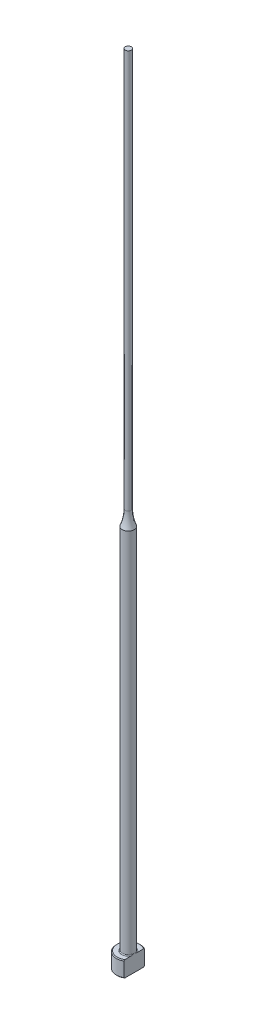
ISO-10303-21;
HEADER;
FILE_DESCRIPTION(('STEP AP214'),'2;1');
FILE_NAME('part.step','',(''),(''),'','','');
FILE_SCHEMA(('AUTOMOTIVE_DESIGN { 1 0 10303 214 1 1 1 1 }'));
ENDSEC;
DATA;
#1=APPLICATION_CONTEXT('core data for automotive mechanical design processes');
#2=APPLICATION_PROTOCOL_DEFINITION('international standard','automotive_design',2000,#1);
#3=PRODUCT_CONTEXT('',#1,'mechanical');
#4=PRODUCT('Part','Part','',(#3));
#5=PRODUCT_RELATED_PRODUCT_CATEGORY('part','',(#4));
#6=PRODUCT_DEFINITION_FORMATION('','',#4);
#7=PRODUCT_DEFINITION_CONTEXT('part definition',#1,'design');
#8=PRODUCT_DEFINITION('design','',#6,#7);
#9=PRODUCT_DEFINITION_SHAPE('','',#8);
#10=(LENGTH_UNIT() NAMED_UNIT(*) SI_UNIT(.MILLI.,.METRE.));
#11=(NAMED_UNIT(*) PLANE_ANGLE_UNIT() SI_UNIT($,.RADIAN.));
#12=(NAMED_UNIT(*) SI_UNIT($,.STERADIAN.) SOLID_ANGLE_UNIT());
#13=UNCERTAINTY_MEASURE_WITH_UNIT(LENGTH_MEASURE(1.E-05),#10,'distance_accuracy_value','');
#14=(GEOMETRIC_REPRESENTATION_CONTEXT(3) GLOBAL_UNCERTAINTY_ASSIGNED_CONTEXT((#13)) GLOBAL_UNIT_ASSIGNED_CONTEXT((#10,
#11,#12)) REPRESENTATION_CONTEXT('',''));
#15=CARTESIAN_POINT('',(0.,0.,0.));
#16=DIRECTION('',(0.,0.,1.));
#17=DIRECTION('',(1.,0.,0.));
#18=AXIS2_PLACEMENT_3D('',#15,#16,#17);
#19=CARTESIAN_POINT('',(-2.99999999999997,4.,0.));
#20=DIRECTION('',(0.,1.,0.));
#21=DIRECTION('',(0.,0.,1.));
#22=AXIS2_PLACEMENT_3D('',#19,#20,#21);
#23=PLANE('',#22);
#24=CARTESIAN_POINT('',(0.,4.,0.));
#25=DIRECTION('',(0.,1.,0.));
#26=DIRECTION('',(0.,0.,1.));
#27=AXIS2_PLACEMENT_3D('',#24,#25,#26);
#28=CIRCLE('',#27,2.79999999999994);
#29=CARTESIAN_POINT('',(1.49999999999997,4.,-2.36431808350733));
#30=VERTEX_POINT('',#29);
#31=CARTESIAN_POINT('',(1.49999999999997,4.,2.36431808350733));
#32=VERTEX_POINT('',#31);
#33=EDGE_CURVE('E187',#30,#32,#28,.T.);
#34=ORIENTED_EDGE('',*,*,#33,.T.);
#35=DIRECTION('',(0.,0.,-1.));
#36=VECTOR('',#35,1.);
#37=CARTESIAN_POINT('',(1.49999999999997,4.,0.));
#38=LINE('',#37,#36);
#39=CARTESIAN_POINT('',(1.49999999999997,3.99999999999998,0.799999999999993));
#40=VERTEX_POINT('',#39);
#41=EDGE_CURVE('E57',#32,#40,#38,.T.);
#42=ORIENTED_EDGE('',*,*,#41,.T.);
#43=CARTESIAN_POINT('',(0.,4.,0.));
#44=DIRECTION('',(0.,1.,0.));
#45=DIRECTION('',(0.,0.,1.));
#46=AXIS2_PLACEMENT_3D('',#43,#44,#45);
#47=CIRCLE('',#46,1.69999999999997);
#48=CARTESIAN_POINT('',(1.49999999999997,3.99999999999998,-0.799999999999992));
#49=VERTEX_POINT('',#48);
#50=EDGE_CURVE('E108',#40,#49,#47,.F.);
#51=ORIENTED_EDGE('',*,*,#50,.T.);
#52=EDGE_CURVE('E137',#49,#30,#38,.T.);
#53=ORIENTED_EDGE('',*,*,#52,.T.);
#54=EDGE_LOOP('',(#34,#42,#51,#53));
#55=FACE_BOUND('',#54,.T.);
#56=ADVANCED_FACE('F32',(#55),#23,.T.);
#57=CARTESIAN_POINT('',(0.,259.958771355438,0.));
#58=DIRECTION('',(0.,1.,0.));
#59=DIRECTION('',(0.,0.,1.));
#60=AXIS2_PLACEMENT_3D('',#57,#58,#59);
#61=CYLINDRICAL_SURFACE('',#60,2.99999999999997);
#62=CARTESIAN_POINT('',(0.,3.79999999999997,0.));
#63=DIRECTION('',(0.,1.,0.));
#64=DIRECTION('',(0.,0.,1.));
#65=AXIS2_PLACEMENT_3D('',#62,#63,#64);
#66=CIRCLE('',#65,2.99999999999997);
#67=CARTESIAN_POINT('',(1.49999999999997,3.79999999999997,2.5980762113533));
#68=VERTEX_POINT('',#67);
#69=CARTESIAN_POINT('',(1.49999999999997,3.79999999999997,-2.5980762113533));
#70=VERTEX_POINT('',#69);
#71=EDGE_CURVE('E105',#68,#70,#66,.F.);
#72=ORIENTED_EDGE('',*,*,#71,.T.);
#73=DIRECTION('',(0.,-1.,0.));
#74=VECTOR('',#73,1.);
#75=CARTESIAN_POINT('',(1.49999999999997,200.,-2.5980762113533));
#76=LINE('',#75,#74);
#77=CARTESIAN_POINT('',(1.49999999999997,0.200000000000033,-2.5980762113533));
#78=VERTEX_POINT('',#77);
#79=EDGE_CURVE('E193',#70,#78,#76,.T.);
#80=ORIENTED_EDGE('',*,*,#79,.T.);
#81=CARTESIAN_POINT('',(0.,0.200000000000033,0.));
#82=DIRECTION('',(0.,-1.,0.));
#83=DIRECTION('',(0.,0.,-1.));
#84=AXIS2_PLACEMENT_3D('',#81,#82,#83);
#85=CIRCLE('',#84,2.99999999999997);
#86=CARTESIAN_POINT('',(1.49999999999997,0.200000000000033,2.5980762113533));
#87=VERTEX_POINT('',#86);
#88=EDGE_CURVE('E100',#78,#87,#85,.F.);
#89=ORIENTED_EDGE('',*,*,#88,.T.);
#90=DIRECTION('',(0.,-1.,0.));
#91=VECTOR('',#90,1.);
#92=CARTESIAN_POINT('',(1.49999999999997,200.,2.5980762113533));
#93=LINE('',#92,#91);
#94=EDGE_CURVE('E93',#68,#87,#93,.T.);
#95=ORIENTED_EDGE('',*,*,#94,.F.);
#96=EDGE_LOOP('',(#72,#80,#89,#95));
#97=FACE_BOUND('',#96,.T.);
#98=ADVANCED_FACE('F158',(#97),#61,.T.);
#99=CARTESIAN_POINT('',(0.,0.,0.));
#100=DIRECTION('',(0.,-1.,0.));
#101=DIRECTION('',(0.,0.,-1.));
#102=AXIS2_PLACEMENT_3D('',#99,#100,#101);
#103=PLANE('',#102);
#104=CARTESIAN_POINT('',(0.,0.,0.));
#105=DIRECTION('',(0.,-1.,0.));
#106=DIRECTION('',(0.,0.,-1.));
#107=AXIS2_PLACEMENT_3D('',#104,#105,#106);
#108=CIRCLE('',#107,2.79999999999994);
#109=CARTESIAN_POINT('',(1.49999999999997,0.,2.36431808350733));
#110=VERTEX_POINT('',#109);
#111=CARTESIAN_POINT('',(1.49999999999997,0.,-2.36431808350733));
#112=VERTEX_POINT('',#111);
#113=EDGE_CURVE('E98',#110,#112,#108,.T.);
#114=ORIENTED_EDGE('',*,*,#113,.T.);
#115=DIRECTION('',(0.,0.,1.));
#116=VECTOR('',#115,1.);
#117=CARTESIAN_POINT('',(1.49999999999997,0.,2.5980762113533));
#118=LINE('',#117,#116);
#119=EDGE_CURVE('E83',#112,#110,#118,.T.);
#120=ORIENTED_EDGE('',*,*,#119,.T.);
#121=EDGE_LOOP('',(#114,#120));
#122=FACE_BOUND('',#121,.T.);
#123=ADVANCED_FACE('F103',(#122),#103,.T.);
#124=CARTESIAN_POINT('',(0.,4.,0.));
#125=DIRECTION('',(0.,-1.,0.));
#126=DIRECTION('',(0.,0.,-1.));
#127=AXIS2_PLACEMENT_3D('',#124,#125,#126);
#128=CONICAL_SURFACE('',#127,2.79999999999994,0.785398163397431);
#129=ORIENTED_EDGE('',*,*,#71,.F.);
#130=CARTESIAN_POINT('',(1.49999999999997,0.888258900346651,5.71827621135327));
#131=CARTESIAN_POINT('',(1.49999999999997,1.01361833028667,5.58866816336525));
#132=CARTESIAN_POINT('',(1.49999999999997,1.13884324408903,5.45892957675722));
#133=CARTESIAN_POINT('',(1.49999999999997,1.38894444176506,5.19911365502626));
#134=CARTESIAN_POINT('',(1.49999999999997,1.51382072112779,5.06903631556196));
#135=CARTESIAN_POINT('',(1.49999999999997,1.76320568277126,4.80840180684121));
#136=CARTESIAN_POINT('',(1.49999999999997,1.88771414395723,4.67784442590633));
#137=CARTESIAN_POINT('',(1.49999999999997,2.13618059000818,4.4162081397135));
#138=CARTESIAN_POINT('',(1.49999999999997,2.26013857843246,4.28512923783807));
#139=CARTESIAN_POINT('',(1.49999999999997,2.50488975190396,4.02490837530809));
#140=CARTESIAN_POINT('',(1.49999999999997,2.62569693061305,3.8957795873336));
#141=CARTESIAN_POINT('',(1.49999999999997,2.86640694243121,3.63668213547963));
#142=CARTESIAN_POINT('',(1.49999999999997,2.98630978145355,3.50671347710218));
#143=CARTESIAN_POINT('',(1.49999999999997,3.22486033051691,3.24567921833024));
#144=CARTESIAN_POINT('',(1.49999999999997,3.3435083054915,3.11461386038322));
#145=CARTESIAN_POINT('',(1.49999999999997,3.5790771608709,2.85094268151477));
#146=CARTESIAN_POINT('',(1.49999999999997,3.69599811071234,2.71833692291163));
#147=CARTESIAN_POINT('',(1.49999999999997,3.88262371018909,2.50255231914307));
#148=CARTESIAN_POINT('',(1.49999999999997,3.95312454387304,2.42006293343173));
#149=CARTESIAN_POINT('',(1.49999999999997,4.09287098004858,2.254010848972));
#150=CARTESIAN_POINT('',(1.49999999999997,4.16211645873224,2.17044804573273));
#151=CARTESIAN_POINT('',(1.49999999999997,4.29964684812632,2.00105967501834));
#152=CARTESIAN_POINT('',(1.49999999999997,4.36791386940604,1.9152195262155));
#153=CARTESIAN_POINT('',(1.49999999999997,4.50205840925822,1.7417139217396));
#154=CARTESIAN_POINT('',(1.49999999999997,4.56793649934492,1.65404891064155));
#155=CARTESIAN_POINT('',(1.49999999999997,4.69728151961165,1.47490236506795));
#156=CARTESIAN_POINT('',(1.49999999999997,4.76069661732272,1.38338308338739));
#157=CARTESIAN_POINT('',(1.49999999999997,4.88239539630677,1.19675661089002));
#158=CARTESIAN_POINT('',(1.49999999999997,4.94067201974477,1.10164473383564));
#159=CARTESIAN_POINT('',(1.49999999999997,5.048413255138,0.908008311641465));
#160=CARTESIAN_POINT('',(1.49999999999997,5.09797809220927,0.809540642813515));
#161=CARTESIAN_POINT('',(1.49999999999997,5.18432188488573,0.607192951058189));
#162=CARTESIAN_POINT('',(1.49999999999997,5.22114374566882,0.50333247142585));
#163=CARTESIAN_POINT('',(1.49999999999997,5.26099935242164,0.347577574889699));
#164=CARTESIAN_POINT('',(1.49999999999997,5.2715702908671,0.297609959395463));
#165=CARTESIAN_POINT('',(1.49999999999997,5.28794860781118,0.196885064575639));
#166=CARTESIAN_POINT('',(1.49999999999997,5.29375640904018,0.146127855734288));
#167=CARTESIAN_POINT('',(1.49999999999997,5.30019707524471,0.0444388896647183));
#168=CARTESIAN_POINT('',(1.49999999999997,5.30084594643,-0.00649183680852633));
#169=CARTESIAN_POINT('',(1.49999999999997,5.29696416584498,-0.108155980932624));
#170=CARTESIAN_POINT('',(1.49999999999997,5.29243308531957,-0.158889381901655));
#171=CARTESIAN_POINT('',(1.49999999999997,5.27856915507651,-0.259234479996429));
#172=CARTESIAN_POINT('',(1.49999999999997,5.2692782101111,-0.308852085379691));
#173=CARTESIAN_POINT('',(1.49999999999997,5.24647108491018,-0.407110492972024));
#174=CARTESIAN_POINT('',(1.49999999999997,5.23295324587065,-0.45575090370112));
#175=CARTESIAN_POINT('',(1.49999999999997,5.20226175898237,-0.55214996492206));
#176=CARTESIAN_POINT('',(1.49999999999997,5.18506801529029,-0.599902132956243));
#177=CARTESIAN_POINT('',(1.49999999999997,5.1477138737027,-0.694205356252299));
#178=CARTESIAN_POINT('',(1.49999999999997,5.12755408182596,-0.740756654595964));
#179=CARTESIAN_POINT('',(1.49999999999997,5.0632769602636,-0.879166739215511));
#180=CARTESIAN_POINT('',(1.49999999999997,5.01551721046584,-0.969329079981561));
#181=CARTESIAN_POINT('',(1.49999999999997,4.91367909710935,-1.14604316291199));
#182=CARTESIAN_POINT('',(1.49999999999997,4.85959300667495,-1.2325903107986));
#183=CARTESIAN_POINT('',(1.49999999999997,4.74697968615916,-1.40321348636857));
#184=CARTESIAN_POINT('',(1.49999999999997,4.68843573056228,-1.4872783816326));
#185=CARTESIAN_POINT('',(1.49999999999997,4.5684384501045,-1.65322187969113));
#186=CARTESIAN_POINT('',(1.49999999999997,4.50698656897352,-1.73510153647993));
#187=CARTESIAN_POINT('',(1.49999999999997,4.3811567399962,-1.89829823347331));
#188=CARTESIAN_POINT('',(1.49999999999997,4.31675092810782,-1.97959369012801));
#189=CARTESIAN_POINT('',(1.49999999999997,4.18634068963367,-2.14090082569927));
#190=CARTESIAN_POINT('',(1.49999999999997,4.12033609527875,-2.22091236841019));
#191=CARTESIAN_POINT('',(1.49999999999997,3.92086431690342,-2.45906508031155));
#192=CARTESIAN_POINT('',(1.49999999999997,3.78562663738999,-2.61572090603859));
#193=CARTESIAN_POINT('',(1.49999999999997,3.53554498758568,-2.90006295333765));
#194=CARTESIAN_POINT('',(1.49999999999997,3.42114543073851,-3.02814382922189));
#195=CARTESIAN_POINT('',(1.49999999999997,3.1909355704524,-3.28303767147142));
#196=CARTESIAN_POINT('',(1.49999999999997,3.07512522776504,-3.40985060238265));
#197=CARTESIAN_POINT('',(1.49999999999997,2.72597067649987,-3.78913849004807));
#198=CARTESIAN_POINT('',(1.49999999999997,2.49111760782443,-4.04022177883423));
#199=CARTESIAN_POINT('',(1.49999999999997,2.0288247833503,-4.52992803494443));
#200=CARTESIAN_POINT('',(1.49999999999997,1.80147747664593,-4.7686387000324));
#201=CARTESIAN_POINT('',(1.49999999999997,1.45954865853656,-5.12558036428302));
#202=CARTESIAN_POINT('',(1.49999999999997,1.34548484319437,-5.24430773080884));
#203=CARTESIAN_POINT('',(1.49999999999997,1.11707176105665,-5.48148573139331));
#204=CARTESIAN_POINT('',(1.49999999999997,1.00272249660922,-5.59993636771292));
#205=CARTESIAN_POINT('',(1.49999999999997,0.888258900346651,-5.71827621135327));
#206=B_SPLINE_CURVE_WITH_KNOTS('',3,(#130,#131,#132,#133,#134,#135,#136,#137,#138,#139,#140,
#141,#142,#143,#144,#145,#146,#147,#148,#149,#150,#151,#152,#153,#154,#155,#156,#157,#158,#159,
#160,#161,#162,#163,#164,#165,#166,#167,#168,#169,#170,#171,#172,#173,#174,#175,#176,#177,#178,
#179,#180,#181,#182,#183,#184,#185,#186,#187,#188,#189,#190,#191,#192,#193,#194,#195,#196,#197,
#198,#199,#200,#201,#202,#203,#204,#205),.UNSPECIFIED.,.F.,.F.,(4,2,2,2,2,2,2,2,2,2,2,2,2,2,2,2,
2,2,2,2,2,2,2,2,2,2,2,2,2,2,2,2,2,2,2,2,2,4),(0.,0.540943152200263,1.08189327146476,
1.62312052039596,2.16434426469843,2.69482920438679,3.22531067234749,3.75567781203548,
4.28602356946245,4.611550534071,4.9371094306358,5.26610945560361,5.59503024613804,
5.92894782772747,6.26331713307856,6.59354403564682,6.92264800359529,7.07567478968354,
7.22868799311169,7.38122626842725,7.53377717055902,7.68500755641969,7.83629736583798,
7.988436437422,8.14054446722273,8.44618799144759,8.75220879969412,9.05944044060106,
9.36652111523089,9.6776428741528,9.98879742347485,10.609592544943,11.1247803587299,
11.6399825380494,12.6713544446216,13.6603005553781,14.1542238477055,14.6481430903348),.UNSPECIFIED.);
#207=EDGE_CURVE('E136',#68,#32,#206,.T.);
#208=ORIENTED_EDGE('',*,*,#207,.T.);
#209=ORIENTED_EDGE('',*,*,#33,.F.);
#210=EDGE_CURVE('E128',#30,#70,#206,.T.);
#211=ORIENTED_EDGE('',*,*,#210,.T.);
#212=EDGE_LOOP('',(#129,#208,#209,#211));
#213=FACE_BOUND('',#212,.T.);
#214=ADVANCED_FACE('F144',(#213),#128,.T.);
#215=CARTESIAN_POINT('',(0.,0.200000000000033,0.));
#216=DIRECTION('',(0.,1.,0.));
#217=DIRECTION('',(0.,0.,1.));
#218=AXIS2_PLACEMENT_3D('',#215,#216,#217);
#219=CONICAL_SURFACE('',#218,2.99999999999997,0.785398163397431);
#220=ORIENTED_EDGE('',*,*,#88,.F.);
#221=CARTESIAN_POINT('',(1.49999999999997,3.11174109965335,-5.71827621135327));
#222=CARTESIAN_POINT('',(1.49999999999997,2.98638166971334,-5.58866816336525));
#223=CARTESIAN_POINT('',(1.49999999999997,2.86115675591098,-5.45892957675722));
#224=CARTESIAN_POINT('',(1.49999999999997,2.61105555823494,-5.19911365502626));
#225=CARTESIAN_POINT('',(1.49999999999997,2.48617927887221,-5.06903631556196));
#226=CARTESIAN_POINT('',(1.49999999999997,2.23679431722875,-4.80840180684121));
#227=CARTESIAN_POINT('',(1.49999999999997,2.11228585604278,-4.67784442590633));
#228=CARTESIAN_POINT('',(1.49999999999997,1.86381940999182,-4.4162081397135));
#229=CARTESIAN_POINT('',(1.49999999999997,1.73986142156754,-4.28512923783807));
#230=CARTESIAN_POINT('',(1.49999999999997,1.49511024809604,-4.02490837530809));
#231=CARTESIAN_POINT('',(1.49999999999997,1.37430306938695,-3.8957795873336));
#232=CARTESIAN_POINT('',(1.49999999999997,1.13359305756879,-3.63668213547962));
#233=CARTESIAN_POINT('',(1.49999999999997,1.01369021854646,-3.50671347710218));
#234=CARTESIAN_POINT('',(1.49999999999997,0.775139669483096,-3.24567921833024));
#235=CARTESIAN_POINT('',(1.49999999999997,0.656491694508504,-3.11461386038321));
#236=CARTESIAN_POINT('',(1.49999999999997,0.420922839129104,-2.85094268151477));
#237=CARTESIAN_POINT('',(1.49999999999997,0.304001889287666,-2.71833692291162));
#238=CARTESIAN_POINT('',(1.49999999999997,0.117376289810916,-2.50255231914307));
#239=CARTESIAN_POINT('',(1.49999999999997,0.0468754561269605,-2.42006293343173));
#240=CARTESIAN_POINT('',(1.49999999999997,-0.0928709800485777,-2.254010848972));
#241=CARTESIAN_POINT('',(1.49999999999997,-0.162116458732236,-2.17044804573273));
#242=CARTESIAN_POINT('',(1.49999999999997,-0.299646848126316,-2.00105967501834));
#243=CARTESIAN_POINT('',(1.49999999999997,-0.367913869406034,-1.9152195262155));
#244=CARTESIAN_POINT('',(1.49999999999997,-0.502058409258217,-1.7417139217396));
#245=CARTESIAN_POINT('',(1.49999999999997,-0.567936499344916,-1.65404891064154));
#246=CARTESIAN_POINT('',(1.49999999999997,-0.697281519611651,-1.47490236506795));
#247=CARTESIAN_POINT('',(1.49999999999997,-0.760696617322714,-1.38338308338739));
#248=CARTESIAN_POINT('',(1.49999999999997,-0.882395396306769,-1.19675661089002));
#249=CARTESIAN_POINT('',(1.49999999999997,-0.940672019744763,-1.10164473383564));
#250=CARTESIAN_POINT('',(1.49999999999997,-1.048413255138,-0.908008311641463));
#251=CARTESIAN_POINT('',(1.49999999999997,-1.09797809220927,-0.809540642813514));
#252=CARTESIAN_POINT('',(1.49999999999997,-1.18432188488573,-0.607192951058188));
#253=CARTESIAN_POINT('',(1.49999999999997,-1.22114374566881,-0.503332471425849));
#254=CARTESIAN_POINT('',(1.49999999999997,-1.26099935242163,-0.347577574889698));
#255=CARTESIAN_POINT('',(1.49999999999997,-1.2715702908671,-0.297609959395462));
#256=CARTESIAN_POINT('',(1.49999999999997,-1.28794860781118,-0.196885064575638));
#257=CARTESIAN_POINT('',(1.49999999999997,-1.29375640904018,-0.146127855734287));
#258=CARTESIAN_POINT('',(1.49999999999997,-1.30019707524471,-0.0444388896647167));
#259=CARTESIAN_POINT('',(1.49999999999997,-1.30084594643,0.00649183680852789));
#260=CARTESIAN_POINT('',(1.49999999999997,-1.29696416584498,0.108155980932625));
#261=CARTESIAN_POINT('',(1.49999999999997,-1.29243308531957,0.158889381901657));
#262=CARTESIAN_POINT('',(1.49999999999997,-1.2785691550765,0.259234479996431));
#263=CARTESIAN_POINT('',(1.49999999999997,-1.2692782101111,0.308852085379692));
#264=CARTESIAN_POINT('',(1.49999999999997,-1.24647108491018,0.407110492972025));
#265=CARTESIAN_POINT('',(1.49999999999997,-1.23295324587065,0.455750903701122));
#266=CARTESIAN_POINT('',(1.49999999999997,-1.20226175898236,0.552149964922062));
#267=CARTESIAN_POINT('',(1.49999999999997,-1.18506801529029,0.599902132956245));
#268=CARTESIAN_POINT('',(1.49999999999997,-1.14771387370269,0.694205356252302));
#269=CARTESIAN_POINT('',(1.49999999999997,-1.12755408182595,0.740756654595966));
#270=CARTESIAN_POINT('',(1.49999999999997,-1.0632769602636,0.879166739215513));
#271=CARTESIAN_POINT('',(1.49999999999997,-1.01551721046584,0.969329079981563));
#272=CARTESIAN_POINT('',(1.49999999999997,-0.913679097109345,1.14604316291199));
#273=CARTESIAN_POINT('',(1.49999999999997,-0.859593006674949,1.2325903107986));
#274=CARTESIAN_POINT('',(1.49999999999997,-0.746979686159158,1.40321348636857));
#275=CARTESIAN_POINT('',(1.49999999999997,-0.688435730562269,1.4872783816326));
#276=CARTESIAN_POINT('',(1.49999999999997,-0.568438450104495,1.65322187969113));
#277=CARTESIAN_POINT('',(1.49999999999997,-0.506986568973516,1.73510153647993));
#278=CARTESIAN_POINT('',(1.49999999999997,-0.381156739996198,1.89829823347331));
#279=CARTESIAN_POINT('',(1.49999999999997,-0.316750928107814,1.97959369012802));
#280=CARTESIAN_POINT('',(1.49999999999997,-0.186340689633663,2.14090082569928));
#281=CARTESIAN_POINT('',(1.49999999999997,-0.12033609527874,2.22091236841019));
#282=CARTESIAN_POINT('',(1.49999999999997,0.0791356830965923,2.45906508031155));
#283=CARTESIAN_POINT('',(1.49999999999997,0.214373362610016,2.61572090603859));
#284=CARTESIAN_POINT('',(1.49999999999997,0.46445501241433,2.90006295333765));
#285=CARTESIAN_POINT('',(1.49999999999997,0.578854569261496,3.02814382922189));
#286=CARTESIAN_POINT('',(1.49999999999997,0.809064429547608,3.28303767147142));
#287=CARTESIAN_POINT('',(1.49999999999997,0.924874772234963,3.40985060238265));
#288=CARTESIAN_POINT('',(1.49999999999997,1.27402932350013,3.78913849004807));
#289=CARTESIAN_POINT('',(1.49999999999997,1.50888239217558,4.04022177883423));
#290=CARTESIAN_POINT('',(1.49999999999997,1.97117521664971,4.52992803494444));
#291=CARTESIAN_POINT('',(1.49999999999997,2.19852252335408,4.76863870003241));
#292=CARTESIAN_POINT('',(1.49999999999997,2.54045134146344,5.12558036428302));
#293=CARTESIAN_POINT('',(1.49999999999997,2.65451515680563,5.24430773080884));
#294=CARTESIAN_POINT('',(1.49999999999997,2.88292823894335,5.48148573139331));
#295=CARTESIAN_POINT('',(1.49999999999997,2.99727750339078,5.59993636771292));
#296=CARTESIAN_POINT('',(1.49999999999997,3.11174109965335,5.71827621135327));
#297=B_SPLINE_CURVE_WITH_KNOTS('',3,(#221,#222,#223,#224,#225,#226,#227,#228,#229,#230,#231,
#232,#233,#234,#235,#236,#237,#238,#239,#240,#241,#242,#243,#244,#245,#246,#247,#248,#249,#250,
#251,#252,#253,#254,#255,#256,#257,#258,#259,#260,#261,#262,#263,#264,#265,#266,#267,#268,#269,
#270,#271,#272,#273,#274,#275,#276,#277,#278,#279,#280,#281,#282,#283,#284,#285,#286,#287,#288,
#289,#290,#291,#292,#293,#294,#295,#296),.UNSPECIFIED.,.F.,.F.,(4,2,2,2,2,2,2,2,2,2,2,2,2,2,2,2,
2,2,2,2,2,2,2,2,2,2,2,2,2,2,2,2,2,2,2,2,2,4),(0.,0.540943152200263,1.08189327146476,
1.62312052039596,2.16434426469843,2.69482920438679,3.22531067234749,3.75567781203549,
4.28602356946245,4.611550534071,4.9371094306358,5.26610945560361,5.59503024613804,
5.92894782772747,6.26331713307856,6.59354403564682,6.92264800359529,7.07567478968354,
7.2286879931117,7.38122626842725,7.53377717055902,7.6850075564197,7.83629736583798,
7.98843643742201,8.14054446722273,8.44618799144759,8.75220879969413,9.05944044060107,
9.3665211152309,9.6776428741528,9.98879742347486,10.609592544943,11.1247803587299,
11.6399825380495,12.6713544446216,13.6603005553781,14.1542238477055,14.6481430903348),.UNSPECIFIED.);
#298=EDGE_CURVE('E86',#78,#112,#297,.T.);
#299=ORIENTED_EDGE('',*,*,#298,.T.);
#300=ORIENTED_EDGE('',*,*,#113,.F.);
#301=EDGE_CURVE('E89',#110,#87,#297,.T.);
#302=ORIENTED_EDGE('',*,*,#301,.T.);
#303=EDGE_LOOP('',(#220,#299,#300,#302));
#304=FACE_BOUND('',#303,.T.);
#305=ADVANCED_FACE('F97',(#304),#219,.T.);
#306=CARTESIAN_POINT('',(0.,4.19999999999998,0.));
#307=DIRECTION('',(0.,1.,0.));
#308=DIRECTION('',(0.,0.,1.));
#309=AXIS2_PLACEMENT_3D('',#306,#307,#308);
#310=TOROIDAL_SURFACE('',#309,1.69999999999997,0.2);
#311=CARTESIAN_POINT('',(1.49999999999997,4.19999999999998,0.));
#312=CARTESIAN_POINT('',(1.49999999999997,4.20000050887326,7.14686674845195E-11));
#313=CARTESIAN_POINT('',(1.49999999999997,4.20000101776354,-1.21663673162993E-07));
#314=CARTESIAN_POINT('',(1.49999999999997,4.20000199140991,-4.97616237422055E-07));
#315=CARTESIAN_POINT('',(1.49999999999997,4.20000245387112,-7.56516220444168E-07));
#316=CARTESIAN_POINT('',(1.49999999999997,4.20000338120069,-1.37642837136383E-06));
#317=CARTESIAN_POINT('',(1.49999999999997,4.20000384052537,-1.74563476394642E-06));
#318=CARTESIAN_POINT('',(1.49999999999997,4.20000469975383,-2.53565984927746E-06));
#319=CARTESIAN_POINT('',(1.49999999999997,4.20000510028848,-2.95582597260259E-06));
#320=CARTESIAN_POINT('',(1.49999999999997,4.20000646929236,-4.48430445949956E-06));
#321=CARTESIAN_POINT('',(1.49999999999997,4.20000736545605,-5.6586103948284E-06));
#322=CARTESIAN_POINT('',(1.49999999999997,4.20000893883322,-8.06479202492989E-06));
#323=CARTESIAN_POINT('',(1.49999999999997,4.20000962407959,-9.29170517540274E-06));
#324=CARTESIAN_POINT('',(1.49999999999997,4.20001225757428,-1.416232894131E-05));
#325=CARTESIAN_POINT('',(1.49999999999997,4.20001407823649,-1.78790031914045E-05));
#326=CARTESIAN_POINT('',(1.49999999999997,4.20001699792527,-2.51443066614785E-05));
#327=CARTESIAN_POINT('',(1.49999999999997,4.20001815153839,-2.86715394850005E-05));
#328=CARTESIAN_POINT('',(1.49999999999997,4.20002315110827,-4.39218128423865E-05));
#329=CARTESIAN_POINT('',(1.49999999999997,4.20002701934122,-5.56288390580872E-05));
#330=CARTESIAN_POINT('',(1.49999999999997,4.20003312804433,-7.7405829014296E-05));
#331=CARTESIAN_POINT('',(1.49999999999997,4.20003553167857,-8.74278412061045E-05));
#332=CARTESIAN_POINT('',(1.49999999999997,4.20005483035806,-0.000161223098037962));
#333=CARTESIAN_POINT('',(1.49999999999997,4.20007979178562,-0.000222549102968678));
#334=CARTESIAN_POINT('',(1.49999999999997,4.20017391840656,-0.000462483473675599));
#335=CARTESIAN_POINT('',(1.49999999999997,4.20023706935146,-0.000642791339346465));
#336=CARTESIAN_POINT('',(1.49999999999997,4.20048761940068,-0.00134785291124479));
#337=CARTESIAN_POINT('',(1.49999999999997,4.20068132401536,-0.00187087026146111));
#338=CARTESIAN_POINT('',(1.49999999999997,4.20147357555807,-0.00402004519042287));
#339=CARTESIAN_POINT('',(1.49999999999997,4.20206499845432,-0.0056481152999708));
#340=CARTESIAN_POINT('',(1.49999999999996,4.20892634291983,-0.0245232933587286));
#341=CARTESIAN_POINT('',(1.49999999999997,4.21523683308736,-0.041759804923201));
#342=CARTESIAN_POINT('',(1.49999999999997,4.22755028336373,-0.0756091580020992));
#343=CARTESIAN_POINT('',(1.49999999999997,4.23355589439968,-0.0922211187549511));
#344=CARTESIAN_POINT('',(1.49999999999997,4.24620101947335,-0.127454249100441));
#345=CARTESIAN_POINT('',(1.49999999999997,4.25283080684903,-0.146078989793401));
#346=CARTESIAN_POINT('',(1.49999999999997,4.26599765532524,-0.183577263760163));
#347=CARTESIAN_POINT('',(1.49999999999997,4.27253305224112,-0.202451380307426));
#348=CARTESIAN_POINT('',(1.49999999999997,4.28834228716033,-0.248982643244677));
#349=CARTESIAN_POINT('',(1.49999999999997,4.2974915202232,-0.276682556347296));
#350=CARTESIAN_POINT('',(1.49999999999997,4.31490935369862,-0.331625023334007));
#351=CARTESIAN_POINT('',(1.49999999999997,4.3231938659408,-0.358862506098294));
#352=CARTESIAN_POINT('',(1.49999999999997,4.34051594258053,-0.419125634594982));
#353=CARTESIAN_POINT('',(1.49999999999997,4.34936607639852,-0.452206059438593));
#354=CARTESIAN_POINT('',(1.49999999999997,4.36549583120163,-0.519023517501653));
#355=CARTESIAN_POINT('',(1.49999999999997,4.37276283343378,-0.552763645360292));
#356=CARTESIAN_POINT('',(1.49999999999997,4.38554755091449,-0.62305310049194));
#357=CARTESIAN_POINT('',(1.49999999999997,4.39090573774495,-0.65963271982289));
#358=CARTESIAN_POINT('',(1.49999999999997,4.39825016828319,-0.733028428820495));
#359=CARTESIAN_POINT('',(1.49999999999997,4.40024734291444,-0.76984335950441));
#360=CARTESIAN_POINT('',(1.49999999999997,4.39970780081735,-0.842856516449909));
#361=CARTESIAN_POINT('',(1.49999999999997,4.39725347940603,-0.879053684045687));
#362=CARTESIAN_POINT('',(1.49999999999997,4.38900085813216,-0.93238076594));
#363=CARTESIAN_POINT('',(1.49999999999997,4.38553049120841,-0.949868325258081));
#364=CARTESIAN_POINT('',(1.49999999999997,4.37678336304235,-0.984374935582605));
#365=CARTESIAN_POINT('',(1.49999999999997,4.37150943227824,-1.00139467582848));
#366=CARTESIAN_POINT('',(1.49999999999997,4.35869781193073,-1.03479423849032));
#367=CARTESIAN_POINT('',(1.49999999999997,4.3511359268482,-1.05116499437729));
#368=CARTESIAN_POINT('',(1.49999999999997,4.33325333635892,-1.08234828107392));
#369=CARTESIAN_POINT('',(1.49999999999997,4.32294266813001,-1.09716621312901));
#370=CARTESIAN_POINT('',(1.49999999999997,4.30512758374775,-1.11714173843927));
#371=CARTESIAN_POINT('',(1.49999999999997,4.29884721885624,-1.12339066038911));
#372=CARTESIAN_POINT('',(1.49999999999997,4.28545950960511,-1.13494695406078));
#373=CARTESIAN_POINT('',(1.49999999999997,4.27835226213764,-1.14025443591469));
#374=CARTESIAN_POINT('',(1.49999999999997,4.26325970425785,-1.14967631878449));
#375=CARTESIAN_POINT('',(1.49999999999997,4.25526534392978,-1.15377649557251));
#376=CARTESIAN_POINT('',(1.49999999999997,4.23863207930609,-1.16034952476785));
#377=CARTESIAN_POINT('',(1.49999999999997,4.22999427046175,-1.16282507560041));
#378=CARTESIAN_POINT('',(1.49999999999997,4.21343922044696,-1.16570267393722));
#379=CARTESIAN_POINT('',(1.49999999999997,4.20555896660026,-1.16631687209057));
#380=CARTESIAN_POINT('',(1.49999999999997,4.18982775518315,-1.16602054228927));
#381=CARTESIAN_POINT('',(1.49999999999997,4.18197679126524,-1.16511036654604));
#382=CARTESIAN_POINT('',(1.49999999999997,4.16747846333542,-1.16204446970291));
#383=CARTESIAN_POINT('',(1.49999999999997,4.16079696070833,-1.16004509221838));
#384=CARTESIAN_POINT('',(1.49999999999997,4.14781700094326,-1.15505972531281));
#385=CARTESIAN_POINT('',(1.49999999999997,4.14151862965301,-1.1520735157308));
#386=CARTESIAN_POINT('',(1.49999999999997,4.12690214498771,-1.14387585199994));
#387=CARTESIAN_POINT('',(1.49999999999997,4.11881436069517,-1.13825400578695));
#388=CARTESIAN_POINT('',(1.49999999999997,4.1036444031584,-1.12578441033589));
#389=CARTESIAN_POINT('',(1.49999999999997,4.09656475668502,-1.11893367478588));
#390=CARTESIAN_POINT('',(1.49999999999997,4.08012297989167,-1.10074342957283));
#391=CARTESIAN_POINT('',(1.49999999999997,4.07136543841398,-1.08886044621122));
#392=CARTESIAN_POINT('',(1.49999999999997,4.05578194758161,-1.06392743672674));
#393=CARTESIAN_POINT('',(1.49999999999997,4.0489571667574,-1.05087671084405));
#394=CARTESIAN_POINT('',(1.49999999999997,4.03273856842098,-1.01472307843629));
#395=CARTESIAN_POINT('',(1.49999999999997,4.02486230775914,-0.990945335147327));
#396=CARTESIAN_POINT('',(1.49999999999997,4.01257693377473,-0.94232199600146));
#397=CARTESIAN_POINT('',(1.49999999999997,4.00820590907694,-0.917467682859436));
#398=CARTESIAN_POINT('',(1.49999999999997,4.00229956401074,-0.867912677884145));
#399=CARTESIAN_POINT('',(1.49999999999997,4.0007128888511,-0.843217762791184));
#400=CARTESIAN_POINT('',(1.49999999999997,3.9996723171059,-0.79374605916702));
#401=CARTESIAN_POINT('',(1.49999999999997,4.0002230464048,-0.768969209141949));
#402=CARTESIAN_POINT('',(1.49999999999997,4.00433101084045,-0.696994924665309));
#403=CARTESIAN_POINT('',(1.49999999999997,4.01016976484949,-0.64993124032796));
#404=CARTESIAN_POINT('',(1.49999999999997,4.02567776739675,-0.559166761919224));
#405=CARTESIAN_POINT('',(1.49999999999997,4.03511950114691,-0.515423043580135));
#406=CARTESIAN_POINT('',(1.49999999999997,4.05693059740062,-0.427590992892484));
#407=CARTESIAN_POINT('',(1.49999999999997,4.06936356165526,-0.383518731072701));
#408=CARTESIAN_POINT('',(1.49999999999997,4.09174953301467,-0.310161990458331));
#409=CARTESIAN_POINT('',(1.49999999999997,4.10119843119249,-0.280718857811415));
#410=CARTESIAN_POINT('',(1.49999999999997,4.12060442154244,-0.22234098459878));
#411=CARTESIAN_POINT('',(1.49999999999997,4.13055519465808,-0.193404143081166));
#412=CARTESIAN_POINT('',(1.49999999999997,4.14973721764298,-0.138756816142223));
#413=CARTESIAN_POINT('',(1.49999999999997,4.15893123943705,-0.113033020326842));
#414=CARTESIAN_POINT('',(1.49999999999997,4.17788037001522,-0.0606351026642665));
#415=CARTESIAN_POINT('',(1.49999999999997,4.18764328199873,-0.0339636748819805));
#416=CARTESIAN_POINT('',(1.49999999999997,4.19793548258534,-0.00564657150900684));
#417=CARTESIAN_POINT('',(1.49999999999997,4.19852751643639,-0.00401699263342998));
#418=CARTESIAN_POINT('',(1.49999999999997,4.1993199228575,-0.0018674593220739));
#419=CARTESIAN_POINT('',(1.49999999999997,4.19951319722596,-0.00134559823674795));
#420=CARTESIAN_POINT('',(1.49999999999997,4.19976322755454,-0.000641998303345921));
#421=CARTESIAN_POINT('',(1.49999999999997,4.19982627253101,-0.000461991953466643));
#422=CARTESIAN_POINT('',(1.49999999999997,4.19992025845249,-0.000222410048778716));
#423=CARTESIAN_POINT('',(1.49999999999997,4.19994519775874,-0.000161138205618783));
#424=CARTESIAN_POINT('',(1.49999999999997,4.19996448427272,-8.74039267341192E-05));
#425=CARTESIAN_POINT('',(1.49999999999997,4.19996688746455,-7.73857556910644E-05));
#426=CARTESIAN_POINT('',(1.49999999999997,4.1999729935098,-5.56173272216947E-05));
#427=CARTESIAN_POINT('',(1.49999999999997,4.19997685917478,-4.39149186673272E-05));
#428=CARTESIAN_POINT('',(1.49999999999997,4.19998185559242,-2.86698156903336E-05));
#429=CARTESIAN_POINT('',(1.49999999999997,4.19998300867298,-2.51431575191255E-05));
#430=CARTESIAN_POINT('',(1.49999999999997,4.19998592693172,-1.78789552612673E-05));
#431=CARTESIAN_POINT('',(1.49999999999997,4.19998774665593,-1.41627846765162E-05));
#432=CARTESIAN_POINT('',(1.49999999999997,4.19999037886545,-9.29264488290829E-06));
#433=CARTESIAN_POINT('',(1.49999999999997,4.19999106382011,-8.06577599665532E-06));
#434=CARTESIAN_POINT('',(1.49999999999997,4.19999263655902,-5.65962639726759E-06));
#435=CARTESIAN_POINT('',(1.49999999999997,4.19999353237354,-4.48530466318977E-06));
#436=CARTESIAN_POINT('',(1.49999999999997,4.19999490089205,-2.95673740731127E-06));
#437=CARTESIAN_POINT('',(1.49999999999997,4.1999953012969,-2.53653208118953E-06));
#438=CARTESIAN_POINT('',(1.49999999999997,4.19999616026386,-1.74640525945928E-06));
#439=CARTESIAN_POINT('',(1.49999999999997,4.19999661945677,-1.37713598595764E-06));
#440=CARTESIAN_POINT('',(1.49999999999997,4.19999754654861,-7.57072336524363E-07));
#441=CARTESIAN_POINT('',(1.49999999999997,4.19999800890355,-4.9808738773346E-07));
#442=CARTESIAN_POINT('',(1.49999999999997,4.19999898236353,-1.21927249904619E-07));
#443=CARTESIAN_POINT('',(1.49999999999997,4.19999949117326,-7.14621294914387E-11));
#444=CARTESIAN_POINT('',(1.49999999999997,4.19999999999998,0.));
#445=B_SPLINE_CURVE_WITH_KNOTS('',3,(#311,#312,#313,#314,#315,#316,#317,#318,#319,#320,#321,
#322,#323,#324,#325,#326,#327,#328,#329,#330,#331,#332,#333,#334,#335,#336,#337,#338,#339,#340,
#341,#342,#343,#344,#345,#346,#347,#348,#349,#350,#351,#352,#353,#354,#355,#356,#357,#358,#359,
#360,#361,#362,#363,#364,#365,#366,#367,#368,#369,#370,#371,#372,#373,#374,#375,#376,#377,#378,
#379,#380,#381,#382,#383,#384,#385,#386,#387,#388,#389,#390,#391,#392,#393,#394,#395,#396,#397,
#398,#399,#400,#401,#402,#403,#404,#405,#406,#407,#408,#409,#410,#411,#412,#413,#414,#415,#416,
#417,#418,#419,#420,#421,#422,#423,#424,#425,#426,#427,#428,#429,#430,#431,#432,#433,#434,#435,
#436,#437,#438,#439,#440,#441,#442,#443,#444),.UNSPECIFIED.,.T.,.F.,(4,2,2,2,2,2,2,2,2,2,2,2,2,
2,2,2,2,2,2,2,2,2,2,2,2,2,2,2,2,2,2,2,2,2,2,2,2,2,2,2,2,2,2,2,2,2,2,2,2,2,2,2,2,2,2,2,2,2,2,2,2,
2,2,2,2,2,4),(0.,1.5268750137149E-06,3.10959387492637E-06,4.86976756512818E-06,
6.60940084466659E-06,1.10202525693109E-05,1.5232779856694E-05,2.7614037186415E-05,
3.87351645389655E-05,7.57188332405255E-05,0.000106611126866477,0.000304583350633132,
0.00087827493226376,0.00255078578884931,0.0077480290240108,0.0628090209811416,0.115802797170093,
0.175110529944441,0.23503061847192,0.32253950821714,0.407938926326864,0.510638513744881,
0.614128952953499,0.724918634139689,0.835347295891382,0.943752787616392,0.997165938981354,
1.05049564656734,1.10441029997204,1.15813071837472,1.18463966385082,1.21114550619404,
1.23795217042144,1.26471419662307,1.2882832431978,1.31184684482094,1.33268332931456,
1.35352446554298,1.38290826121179,1.41236445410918,1.45639976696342,1.50046164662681,
1.57518788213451,1.65071550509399,1.72483484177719,1.79911468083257,1.94105061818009,
2.07520625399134,2.2125154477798,2.30527614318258,2.39707056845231,2.47902409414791,
2.56422207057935,2.56942417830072,2.57109299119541,2.57166572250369,2.57186352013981,
2.57189440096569,2.57193136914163,2.57194248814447,2.57195486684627,2.57195907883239,
2.57196348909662,2.57196522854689,2.57196698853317,2.57196857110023,2.57197009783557),.UNSPECIFIED.);
#446=CARTESIAN_POINT('',(1.49999999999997,4.19999999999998,0.));
#447=VERTEX_POINT('',#446);
#448=EDGE_CURVE('E11',#49,#447,#445,.T.);
#449=ORIENTED_EDGE('',*,*,#448,.F.);
#450=ORIENTED_EDGE('',*,*,#50,.F.);
#451=CARTESIAN_POINT('',(1.49999999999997,4.19999999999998,0.));
#452=CARTESIAN_POINT('',(1.49999999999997,4.1999994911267,-7.1468641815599E-11));
#453=CARTESIAN_POINT('',(1.49999999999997,4.19999898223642,1.21663673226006E-07));
#454=CARTESIAN_POINT('',(1.49999999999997,4.19999800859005,4.97616237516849E-07));
#455=CARTESIAN_POINT('',(1.49999999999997,4.19999754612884,7.56516220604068E-07));
#456=CARTESIAN_POINT('',(1.49999999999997,4.19999661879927,1.37642837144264E-06));
#457=CARTESIAN_POINT('',(1.49999999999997,4.1999961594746,1.74563476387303E-06));
#458=CARTESIAN_POINT('',(1.49999999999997,4.19999530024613,2.5356598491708E-06));
#459=CARTESIAN_POINT('',(1.49999999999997,4.19999489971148,2.95582597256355E-06));
#460=CARTESIAN_POINT('',(1.49999999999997,4.1999935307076,4.48430445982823E-06));
#461=CARTESIAN_POINT('',(1.49999999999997,4.19999263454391,5.6586103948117E-06));
#462=CARTESIAN_POINT('',(1.49999999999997,4.19999106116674,8.06479202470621E-06));
#463=CARTESIAN_POINT('',(1.49999999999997,4.19999037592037,9.29170517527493E-06));
#464=CARTESIAN_POINT('',(1.49999999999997,4.19998774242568,1.41623289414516E-05));
#465=CARTESIAN_POINT('',(1.49999999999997,4.19998592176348,1.78790031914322E-05));
#466=CARTESIAN_POINT('',(1.49999999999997,4.1999830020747,2.51443066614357E-05));
#467=CARTESIAN_POINT('',(1.49999999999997,4.19998184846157,2.86715394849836E-05));
#468=CARTESIAN_POINT('',(1.49999999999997,4.1999768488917,4.39218128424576E-05));
#469=CARTESIAN_POINT('',(1.49999999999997,4.19997298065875,5.56288390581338E-05));
#470=CARTESIAN_POINT('',(1.49999999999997,4.19996687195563,7.7405829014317E-05));
#471=CARTESIAN_POINT('',(1.49999999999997,4.19996446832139,8.74278412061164E-05));
#472=CARTESIAN_POINT('',(1.49999999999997,4.1999451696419,0.000161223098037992));
#473=CARTESIAN_POINT('',(1.49999999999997,4.19992020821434,0.000222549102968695));
#474=CARTESIAN_POINT('',(1.49999999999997,4.19982608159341,0.000462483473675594));
#475=CARTESIAN_POINT('',(1.49999999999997,4.1997629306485,0.000642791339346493));
#476=CARTESIAN_POINT('',(1.49999999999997,4.19951238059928,0.00134785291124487));
#477=CARTESIAN_POINT('',(1.49999999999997,4.19931867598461,0.00187087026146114));
#478=CARTESIAN_POINT('',(1.49999999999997,4.19852642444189,0.00402004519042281));
#479=CARTESIAN_POINT('',(1.49999999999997,4.19793500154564,0.00564811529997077));
#480=CARTESIAN_POINT('',(1.49999999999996,4.19107365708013,0.0245232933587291));
#481=CARTESIAN_POINT('',(1.49999999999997,4.1847631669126,0.0417598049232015));
#482=CARTESIAN_POINT('',(1.49999999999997,4.17244971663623,0.0756091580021));
#483=CARTESIAN_POINT('',(1.49999999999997,4.16644410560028,0.0922211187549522));
#484=CARTESIAN_POINT('',(1.49999999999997,4.15379898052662,0.127454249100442));
#485=CARTESIAN_POINT('',(1.49999999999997,4.14716919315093,0.146078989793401));
#486=CARTESIAN_POINT('',(1.49999999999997,4.13400234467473,0.183577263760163));
#487=CARTESIAN_POINT('',(1.49999999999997,4.12746694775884,0.202451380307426));
#488=CARTESIAN_POINT('',(1.49999999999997,4.11165771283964,0.248982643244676));
#489=CARTESIAN_POINT('',(1.49999999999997,4.10250847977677,0.276682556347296));
#490=CARTESIAN_POINT('',(1.49999999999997,4.08509064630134,0.331625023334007));
#491=CARTESIAN_POINT('',(1.49999999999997,4.07680613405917,0.358862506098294));
#492=CARTESIAN_POINT('',(1.49999999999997,4.05948405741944,0.419125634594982));
#493=CARTESIAN_POINT('',(1.49999999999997,4.05063392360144,0.452206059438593));
#494=CARTESIAN_POINT('',(1.49999999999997,4.03450416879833,0.519023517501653));
#495=CARTESIAN_POINT('',(1.49999999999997,4.02723716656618,0.552763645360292));
#496=CARTESIAN_POINT('',(1.49999999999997,4.01445244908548,0.62305310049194));
#497=CARTESIAN_POINT('',(1.49999999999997,4.00909426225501,0.659632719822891));
#498=CARTESIAN_POINT('',(1.49999999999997,4.00174983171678,0.733028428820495));
#499=CARTESIAN_POINT('',(1.49999999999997,3.99975265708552,0.76984335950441));
#500=CARTESIAN_POINT('',(1.49999999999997,4.00029219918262,0.842856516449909));
#501=CARTESIAN_POINT('',(1.49999999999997,4.00274652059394,0.879053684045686));
#502=CARTESIAN_POINT('',(1.49999999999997,4.0109991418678,0.93238076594));
#503=CARTESIAN_POINT('',(1.49999999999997,4.01446950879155,0.949868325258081));
#504=CARTESIAN_POINT('',(1.49999999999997,4.02321663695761,0.984374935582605));
#505=CARTESIAN_POINT('',(1.49999999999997,4.02849056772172,1.00139467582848));
#506=CARTESIAN_POINT('',(1.49999999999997,4.04130218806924,1.03479423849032));
#507=CARTESIAN_POINT('',(1.49999999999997,4.04886407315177,1.05116499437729));
#508=CARTESIAN_POINT('',(1.49999999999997,4.06674666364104,1.08234828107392));
#509=CARTESIAN_POINT('',(1.49999999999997,4.07705733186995,1.09716621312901));
#510=CARTESIAN_POINT('',(1.49999999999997,4.09487241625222,1.11714173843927));
#511=CARTESIAN_POINT('',(1.49999999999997,4.10115278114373,1.12339066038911));
#512=CARTESIAN_POINT('',(1.49999999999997,4.11454049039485,1.13494695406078));
#513=CARTESIAN_POINT('',(1.49999999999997,4.12164773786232,1.14025443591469));
#514=CARTESIAN_POINT('',(1.49999999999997,4.13674029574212,1.14967631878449));
#515=CARTESIAN_POINT('',(1.49999999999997,4.14473465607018,1.15377649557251));
#516=CARTESIAN_POINT('',(1.49999999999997,4.16136792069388,1.16034952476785));
#517=CARTESIAN_POINT('',(1.49999999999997,4.17000572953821,1.16282507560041));
#518=CARTESIAN_POINT('',(1.49999999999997,4.186560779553,1.16570267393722));
#519=CARTESIAN_POINT('',(1.49999999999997,4.1944410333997,1.16631687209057));
#520=CARTESIAN_POINT('',(1.49999999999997,4.21017224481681,1.16602054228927));
#521=CARTESIAN_POINT('',(1.49999999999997,4.21802320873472,1.16511036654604));
#522=CARTESIAN_POINT('',(1.49999999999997,4.23252153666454,1.16204446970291));
#523=CARTESIAN_POINT('',(1.49999999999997,4.23920303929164,1.16004509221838));
#524=CARTESIAN_POINT('',(1.49999999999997,4.2521829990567,1.15505972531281));
#525=CARTESIAN_POINT('',(1.49999999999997,4.25848137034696,1.1520735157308));
#526=CARTESIAN_POINT('',(1.49999999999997,4.27309785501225,1.14387585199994));
#527=CARTESIAN_POINT('',(1.49999999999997,4.28118563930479,1.13825400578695));
#528=CARTESIAN_POINT('',(1.49999999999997,4.29635559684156,1.12578441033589));
#529=CARTESIAN_POINT('',(1.49999999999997,4.30343524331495,1.11893367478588));
#530=CARTESIAN_POINT('',(1.49999999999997,4.31987702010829,1.10074342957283));
#531=CARTESIAN_POINT('',(1.49999999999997,4.32863456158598,1.08886044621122));
#532=CARTESIAN_POINT('',(1.49999999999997,4.34421805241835,1.06392743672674));
#533=CARTESIAN_POINT('',(1.49999999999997,4.35104283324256,1.05087671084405));
#534=CARTESIAN_POINT('',(1.49999999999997,4.36726143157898,1.01472307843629));
#535=CARTESIAN_POINT('',(1.49999999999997,4.37513769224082,0.990945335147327));
#536=CARTESIAN_POINT('',(1.49999999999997,4.38742306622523,0.94232199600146));
#537=CARTESIAN_POINT('',(1.49999999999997,4.39179409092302,0.917467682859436));
#538=CARTESIAN_POINT('',(1.49999999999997,4.39770043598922,0.867912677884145));
#539=CARTESIAN_POINT('',(1.49999999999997,4.39928711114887,0.843217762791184));
#540=CARTESIAN_POINT('',(1.49999999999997,4.40032768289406,0.79374605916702));
#541=CARTESIAN_POINT('',(1.49999999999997,4.39977695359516,0.768969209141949));
#542=CARTESIAN_POINT('',(1.49999999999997,4.39566898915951,0.696994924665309));
#543=CARTESIAN_POINT('',(1.49999999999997,4.38983023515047,0.64993124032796));
#544=CARTESIAN_POINT('',(1.49999999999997,4.37432223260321,0.559166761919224));
#545=CARTESIAN_POINT('',(1.49999999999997,4.36488049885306,0.515423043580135));
#546=CARTESIAN_POINT('',(1.49999999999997,4.34306940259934,0.427590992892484));
#547=CARTESIAN_POINT('',(1.49999999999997,4.33063643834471,0.383518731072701));
#548=CARTESIAN_POINT('',(1.49999999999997,4.30825046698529,0.310161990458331));
#549=CARTESIAN_POINT('',(1.49999999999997,4.29880156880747,0.280718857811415));
#550=CARTESIAN_POINT('',(1.49999999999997,4.27939557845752,0.22234098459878));
#551=CARTESIAN_POINT('',(1.49999999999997,4.26944480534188,0.193404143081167));
#552=CARTESIAN_POINT('',(1.49999999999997,4.25026278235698,0.138756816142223));
#553=CARTESIAN_POINT('',(1.49999999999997,4.24106876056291,0.113033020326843));
#554=CARTESIAN_POINT('',(1.49999999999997,4.22211962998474,0.0606351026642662));
#555=CARTESIAN_POINT('',(1.49999999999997,4.21235671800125,0.0339636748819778));
#556=CARTESIAN_POINT('',(1.49999999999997,4.20206451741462,0.00564657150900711));
#557=CARTESIAN_POINT('',(1.49999999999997,4.20147248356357,0.00401699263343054));
#558=CARTESIAN_POINT('',(1.49999999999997,4.20068007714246,0.00186745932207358));
#559=CARTESIAN_POINT('',(1.49999999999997,4.200486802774,0.00134559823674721));
#560=CARTESIAN_POINT('',(1.49999999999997,4.20023677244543,0.000641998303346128));
#561=CARTESIAN_POINT('',(1.49999999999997,4.20017372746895,0.000461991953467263));
#562=CARTESIAN_POINT('',(1.49999999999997,4.20007974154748,0.000222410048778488));
#563=CARTESIAN_POINT('',(1.49999999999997,4.20005480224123,0.000161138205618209));
#564=CARTESIAN_POINT('',(1.49999999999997,4.20003551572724,8.74039267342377E-05));
#565=CARTESIAN_POINT('',(1.49999999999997,4.20003311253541,7.73857556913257E-05));
#566=CARTESIAN_POINT('',(1.49999999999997,4.20002700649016,5.56173272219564E-05));
#567=CARTESIAN_POINT('',(1.49999999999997,4.20002314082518,4.39149186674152E-05));
#568=CARTESIAN_POINT('',(1.49999999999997,4.20001814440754,2.86698156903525E-05));
#569=CARTESIAN_POINT('',(1.49999999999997,4.20001699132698,2.51431575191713E-05));
#570=CARTESIAN_POINT('',(1.49999999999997,4.20001407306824,1.78789552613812E-05));
#571=CARTESIAN_POINT('',(1.49999999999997,4.20001225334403,1.41627846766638E-05));
#572=CARTESIAN_POINT('',(1.49999999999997,4.20000962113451,9.29264488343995E-06));
#573=CARTESIAN_POINT('',(1.49999999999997,4.20000893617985,8.06577599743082E-06));
#574=CARTESIAN_POINT('',(1.49999999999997,4.20000736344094,5.65962639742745E-06));
#575=CARTESIAN_POINT('',(1.49999999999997,4.20000646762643,4.4853046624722E-06));
#576=CARTESIAN_POINT('',(1.49999999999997,4.20000509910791,2.95673740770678E-06));
#577=CARTESIAN_POINT('',(1.49999999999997,4.20000469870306,2.53653208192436E-06));
#578=CARTESIAN_POINT('',(1.49999999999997,4.2000038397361,1.74640526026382E-06));
#579=CARTESIAN_POINT('',(1.49999999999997,4.20000338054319,1.37713598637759E-06));
#580=CARTESIAN_POINT('',(1.49999999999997,4.20000245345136,7.5707233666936E-07));
#581=CARTESIAN_POINT('',(1.49999999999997,4.20000199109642,4.98087387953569E-07));
#582=CARTESIAN_POINT('',(1.49999999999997,4.20000101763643,1.2192725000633E-07));
#583=CARTESIAN_POINT('',(1.49999999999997,4.20000050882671,7.14621038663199E-11));
#584=CARTESIAN_POINT('',(1.49999999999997,4.19999999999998,0.));
#585=B_SPLINE_CURVE_WITH_KNOTS('',3,(#451,#452,#453,#454,#455,#456,#457,#458,#459,#460,#461,
#462,#463,#464,#465,#466,#467,#468,#469,#470,#471,#472,#473,#474,#475,#476,#477,#478,#479,#480,
#481,#482,#483,#484,#485,#486,#487,#488,#489,#490,#491,#492,#493,#494,#495,#496,#497,#498,#499,
#500,#501,#502,#503,#504,#505,#506,#507,#508,#509,#510,#511,#512,#513,#514,#515,#516,#517,#518,
#519,#520,#521,#522,#523,#524,#525,#526,#527,#528,#529,#530,#531,#532,#533,#534,#535,#536,#537,
#538,#539,#540,#541,#542,#543,#544,#545,#546,#547,#548,#549,#550,#551,#552,#553,#554,#555,#556,
#557,#558,#559,#560,#561,#562,#563,#564,#565,#566,#567,#568,#569,#570,#571,#572,#573,#574,#575,
#576,#577,#578,#579,#580,#581,#582,#583,#584),.UNSPECIFIED.,.T.,.F.,(4,2,2,2,2,2,2,2,2,2,2,2,2,
2,2,2,2,2,2,2,2,2,2,2,2,2,2,2,2,2,2,2,2,2,2,2,2,2,2,2,2,2,2,2,2,2,2,2,2,2,2,2,2,2,2,2,2,2,2,2,2,
2,2,2,2,2,4),(0.,1.5268750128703E-06,3.10959387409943E-06,4.86976756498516E-06,
6.60940084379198E-06,1.10202525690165E-05,1.52327798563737E-05,2.76140371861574E-05,
3.87351645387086E-05,7.57188332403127E-05,0.000106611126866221,0.000304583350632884,
0.000878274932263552,0.00255078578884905,0.00774802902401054,0.062809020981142,
0.115802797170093,0.175110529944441,0.235030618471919,0.32253950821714,0.407938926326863,
0.510638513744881,0.614128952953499,0.72491863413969,0.835347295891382,0.943752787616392,
0.997165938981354,1.05049564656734,1.10441029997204,1.15813071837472,1.18463966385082,
1.21114550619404,1.23795217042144,1.26471419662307,1.2882832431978,1.31184684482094,
1.33268332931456,1.35352446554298,1.38290826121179,1.41236445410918,1.45639976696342,
1.50046164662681,1.57518788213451,1.65071550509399,1.72483484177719,1.79911468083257,
1.94105061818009,2.07520625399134,2.2125154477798,2.30527614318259,2.39707056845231,
2.47902409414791,2.56422207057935,2.56942417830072,2.57109299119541,2.57166572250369,
2.57186352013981,2.57189440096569,2.57193136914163,2.57194248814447,2.57195486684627,
2.57195907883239,2.57196348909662,2.57196522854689,2.57196698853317,2.57196857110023,
2.57197009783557),.UNSPECIFIED.);
#586=EDGE_CURVE('E46',#447,#40,#585,.T.);
#587=ORIENTED_EDGE('',*,*,#586,.F.);
#588=CARTESIAN_POINT('',(0.,4.19999999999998,0.));
#589=DIRECTION('',(0.,1.,0.));
#590=DIRECTION('',(0.,0.,1.));
#591=AXIS2_PLACEMENT_3D('',#588,#589,#590);
#592=CIRCLE('',#591,1.49999999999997);
#593=EDGE_CURVE('E104',#447,#447,#592,.T.);
#594=ORIENTED_EDGE('',*,*,#593,.F.);
#595=EDGE_LOOP('',(#449,#450,#587,#594));
#596=FACE_BOUND('',#595,.T.);
#597=ADVANCED_FACE('F34',(#596),#310,.F.);
#598=CARTESIAN_POINT('',(-0.749999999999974,200.,0.));
#599=DIRECTION('',(0.,1.,0.));
#600=DIRECTION('',(0.,0.,1.));
#601=AXIS2_PLACEMENT_3D('',#598,#599,#600);
#602=PLANE('',#601);
#603=CARTESIAN_POINT('',(0.,200.,0.));
#604=DIRECTION('',(0.,1.,0.));
#605=DIRECTION('',(0.,0.,1.));
#606=AXIS2_PLACEMENT_3D('',#603,#604,#605);
#607=CIRCLE('',#606,0.749999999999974);
#608=CARTESIAN_POINT('',(0.,200.,0.749999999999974));
#609=VERTEX_POINT('',#608);
#610=EDGE_CURVE('E186',#609,#609,#607,.T.);
#611=ORIENTED_EDGE('',*,*,#610,.T.);
#612=EDGE_LOOP('',(#611));
#613=FACE_BOUND('',#612,.T.);
#614=ADVANCED_FACE('F149',(#613),#602,.T.);
#615=CARTESIAN_POINT('',(0.,259.958771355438,0.));
#616=DIRECTION('',(0.,1.,0.));
#617=DIRECTION('',(0.,0.,1.));
#618=AXIS2_PLACEMENT_3D('',#615,#616,#617);
#619=CYLINDRICAL_SURFACE('',#618,0.749999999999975);
#620=CARTESIAN_POINT('',(0.,100.,0.));
#621=DIRECTION('',(0.,1.,0.));
#622=DIRECTION('',(0.,0.,1.));
#623=AXIS2_PLACEMENT_3D('',#620,#621,#622);
#624=CIRCLE('',#623,0.749999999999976);
#625=CARTESIAN_POINT('',(0.,100.,0.749999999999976));
#626=VERTEX_POINT('',#625);
#627=EDGE_CURVE('E183',#626,#626,#624,.T.);
#628=ORIENTED_EDGE('',*,*,#627,.T.);
#629=EDGE_LOOP('',(#628));
#630=FACE_BOUND('',#629,.T.);
#631=ORIENTED_EDGE('',*,*,#610,.F.);
#632=EDGE_LOOP('',(#631));
#633=FACE_BOUND('',#632,.T.);
#634=ADVANCED_FACE('F172',(#630,#633),#619,.T.);
#635=CARTESIAN_POINT('',(0.,100.,0.));
#636=DIRECTION('',(0.,1.,0.));
#637=DIRECTION('',(0.,0.,1.));
#638=AXIS2_PLACEMENT_3D('',#635,#636,#637);
#639=TOROIDAL_SURFACE('',#638,10.75,10.);
#640=CARTESIAN_POINT('',(0.,96.2003289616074,0.));
#641=DIRECTION('',(0.,1.,0.));
#642=DIRECTION('',(0.,0.,1.));
#643=AXIS2_PLACEMENT_3D('',#640,#641,#642);
#644=CIRCLE('',#643,1.49999999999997);
#645=CARTESIAN_POINT('',(0.,96.2003289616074,1.49999999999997));
#646=VERTEX_POINT('',#645);
#647=EDGE_CURVE('E101',#646,#646,#644,.T.);
#648=ORIENTED_EDGE('',*,*,#647,.T.);
#649=EDGE_LOOP('',(#648));
#650=FACE_BOUND('',#649,.T.);
#651=ORIENTED_EDGE('',*,*,#627,.F.);
#652=EDGE_LOOP('',(#651));
#653=FACE_BOUND('',#652,.T.);
#654=ADVANCED_FACE('F169',(#650,#653),#639,.F.);
#655=CARTESIAN_POINT('',(0.,259.958771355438,0.));
#656=DIRECTION('',(0.,1.,0.));
#657=DIRECTION('',(0.,0.,1.));
#658=AXIS2_PLACEMENT_3D('',#655,#656,#657);
#659=CYLINDRICAL_SURFACE('',#658,1.49999999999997);
#660=ORIENTED_EDGE('',*,*,#593,.T.);
#661=EDGE_LOOP('',(#660));
#662=FACE_BOUND('',#661,.T.);
#663=ORIENTED_EDGE('',*,*,#647,.F.);
#664=EDGE_LOOP('',(#663));
#665=FACE_BOUND('',#664,.T.);
#666=ADVANCED_FACE('F122',(#662,#665),#659,.T.);
#667=CARTESIAN_POINT('',(1.49999999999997,200.,2.5980762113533));
#668=DIRECTION('',(1.,0.,0.));
#669=DIRECTION('',(0.,0.,-1.));
#670=AXIS2_PLACEMENT_3D('',#667,#668,#669);
#671=PLANE('',#670);
#672=ORIENTED_EDGE('',*,*,#79,.F.);
#673=ORIENTED_EDGE('',*,*,#210,.F.);
#674=ORIENTED_EDGE('',*,*,#52,.F.);
#675=ORIENTED_EDGE('',*,*,#448,.T.);
#676=ORIENTED_EDGE('',*,*,#586,.T.);
#677=ORIENTED_EDGE('',*,*,#41,.F.);
#678=ORIENTED_EDGE('',*,*,#207,.F.);
#679=ORIENTED_EDGE('',*,*,#94,.T.);
#680=ORIENTED_EDGE('',*,*,#301,.F.);
#681=ORIENTED_EDGE('',*,*,#119,.F.);
#682=ORIENTED_EDGE('',*,*,#298,.F.);
#683=EDGE_LOOP('',(#672,#673,#674,#675,#676,#677,#678,#679,#680,#681,#682));
#684=FACE_BOUND('',#683,.T.);
#685=ADVANCED_FACE('F85',(#684),#671,.T.);
#686=CLOSED_SHELL('',(#56,#98,#123,#214,#305,#597,#614,#634,#654,#666,#685));
#687=MANIFOLD_SOLID_BREP('B2',#686);
#688=ADVANCED_BREP_SHAPE_REPRESENTATION('',(#18,#687),#14);
#689=SHAPE_DEFINITION_REPRESENTATION(#9,#688);
ENDSEC;
END-ISO-10303-21;
